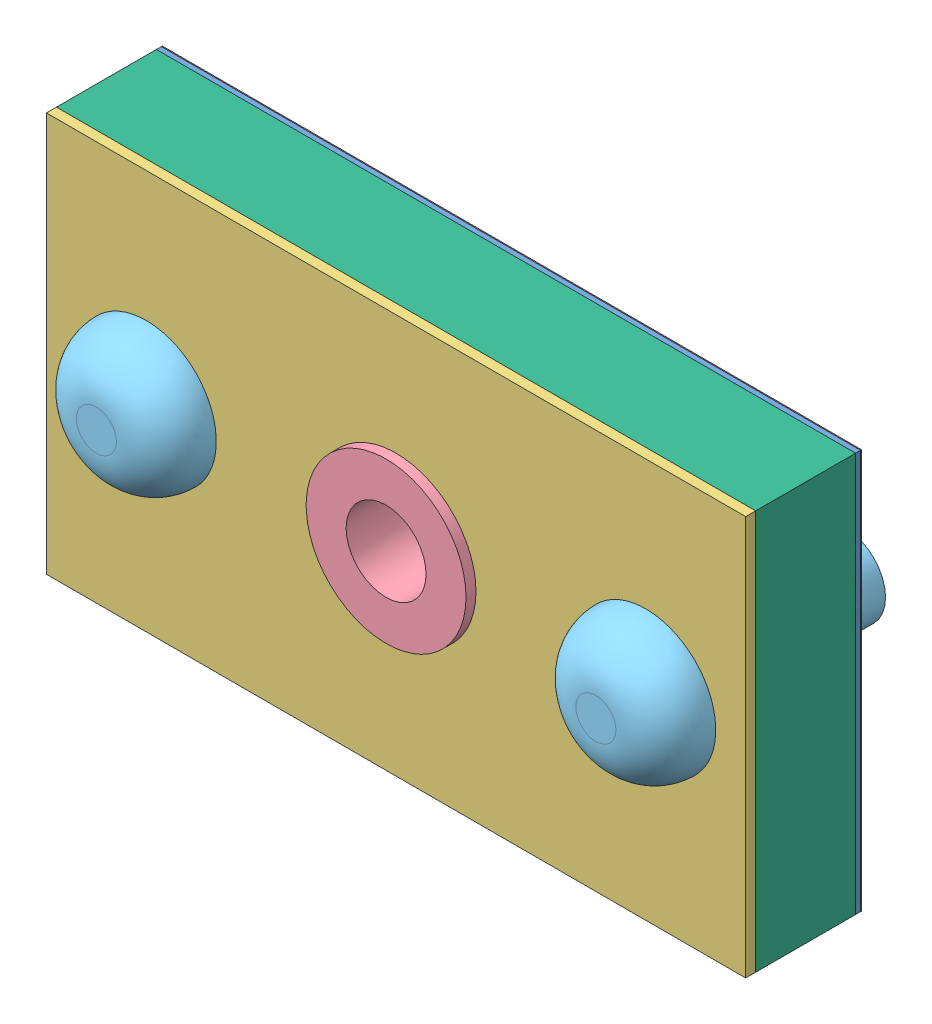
SolidWorks assembly Y-Rodamiento completo.SLDASM, configuration Predeterminado (file format 3800). Lengths in mm.
Overall size (70 40 25).
10 component instances, 7 part files, 0 mates.
Components (placement in the parent):
- Y-Apollo Soporte-1: Y-Apollo Soporte.SLDPRT [Predeterminado] at (0 0 -10) x (-1 0 0) z (0 0 -1) size (70 40 0.5)
- Y-Protector completo fino-1: Y-Protector completo fino.SLDPRT [Predeterminado] at (0 0 -10.5) x (-1 0 0) z (0 0 -1) size (70 40 0.1)
- Y-Protector con agujero-1: Y-Protector con agujero.SLDPRT [Predeterminado] at (0 0 1) x (-1 0 0) z (0 0 -1) size (70 40 1)
- Y-Funda ()-1: Y-Funda ().SLDPRT [Predeterminado] at (0 0 2) x (-1 0 0) z (0 0 -1) size (16 16 10)
- Y-Rodamiento con soporte y tornillo-1: Y-Rodamiento con soporte y tornillo.SLDASM [Predeterminado] at (0 0 0.5) size (70 40 25)
  - Y-Tornillo M8 x20-2: Y-Tornillo M8 x20.SLDPRT [Predeterminado] at (-25 0 5.5) x (-1 0 0) z (0 0 -1) size (14 14 25)
  - Y-Tornillo M8 x20-1: Y-Tornillo M8 x20.SLDPRT [Predeterminado] at (25 0 5.5) x (-1 0 0) z (0 0 -1) size (14 14 25)
  - Y-Rodamiento con soporte-1: Y-Rodamiento con soporte.SLDASM [Predeterminado] at (0 0 -10.5) size (70 40 10)
    - Y-Soporte rodamiento-1: Y-Soporte rodamiento.SLDPRT [Predeterminado] at origin size (70 40 10)
    - Y-Rodamiento (7201.2RS.TVP)-1: Y-Rodamiento (7201.2RS.TVP).SLDPRT [Predeterminado] at origin size (32 32 10)
